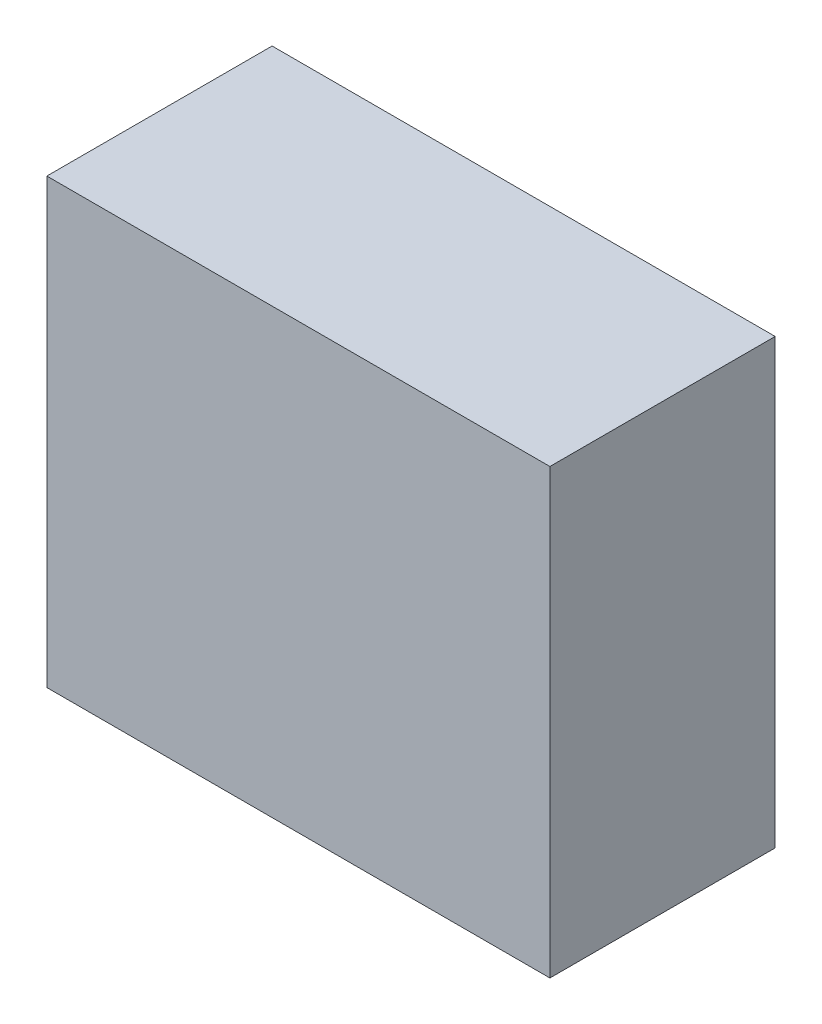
ISO-10303-21;
HEADER;
FILE_DESCRIPTION(('STEP AP214'),'2;1');
FILE_NAME('part.step','',(''),(''),'','','');
FILE_SCHEMA(('AUTOMOTIVE_DESIGN { 1 0 10303 214 1 1 1 1 }'));
ENDSEC;
DATA;
#1=APPLICATION_CONTEXT('core data for automotive mechanical design processes');
#2=APPLICATION_PROTOCOL_DEFINITION('international standard','automotive_design',2000,#1);
#3=PRODUCT_CONTEXT('',#1,'mechanical');
#4=PRODUCT('Part','Part','',(#3));
#5=PRODUCT_RELATED_PRODUCT_CATEGORY('part','',(#4));
#6=PRODUCT_DEFINITION_FORMATION('','',#4);
#7=PRODUCT_DEFINITION_CONTEXT('part definition',#1,'design');
#8=PRODUCT_DEFINITION('design','',#6,#7);
#9=PRODUCT_DEFINITION_SHAPE('','',#8);
#10=(LENGTH_UNIT() NAMED_UNIT(*) SI_UNIT(.MILLI.,.METRE.));
#11=(NAMED_UNIT(*) PLANE_ANGLE_UNIT() SI_UNIT($,.RADIAN.));
#12=(NAMED_UNIT(*) SI_UNIT($,.STERADIAN.) SOLID_ANGLE_UNIT());
#13=UNCERTAINTY_MEASURE_WITH_UNIT(LENGTH_MEASURE(1.E-05),#10,'distance_accuracy_value','');
#14=(GEOMETRIC_REPRESENTATION_CONTEXT(3) GLOBAL_UNCERTAINTY_ASSIGNED_CONTEXT((#13)) GLOBAL_UNIT_ASSIGNED_CONTEXT((#10,
#11,#12)) REPRESENTATION_CONTEXT('',''));
#15=CARTESIAN_POINT('',(0.,0.,0.));
#16=DIRECTION('',(0.,0.,1.));
#17=DIRECTION('',(1.,0.,0.));
#18=AXIS2_PLACEMENT_3D('',#15,#16,#17);
#19=CARTESIAN_POINT('',(-3.35000092,-2.94999918,2.99999908));
#20=DIRECTION('',(0.,0.,-1.));
#21=DIRECTION('',(-1.,0.,0.));
#22=AXIS2_PLACEMENT_3D('',#19,#20,#21);
#23=PLANE('',#22);
#24=DIRECTION('',(0.,1.,0.));
#25=VECTOR('',#24,1.);
#26=CARTESIAN_POINT('',(3.35000346,-2.95000172,2.99999908));
#27=LINE('',#26,#25);
#28=CARTESIAN_POINT('',(3.35000346,-2.95000172,2.99999908));
#29=VERTEX_POINT('',#28);
#30=CARTESIAN_POINT('',(3.35000346,2.95000299,2.99999908));
#31=VERTEX_POINT('',#30);
#32=EDGE_CURVE('E54',#29,#31,#27,.T.);
#33=ORIENTED_EDGE('',*,*,#32,.T.);
#34=DIRECTION('',(0.999999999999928,-3.79104229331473E-07,0.));
#35=VECTOR('',#34,1.);
#36=CARTESIAN_POINT('',(3.35000346,2.95000172,2.99999908));
#37=LINE('',#36,#35);
#38=CARTESIAN_POINT('',(-3.35000092,2.95000426,2.99999908));
#39=VERTEX_POINT('',#38);
#40=EDGE_CURVE('E56',#31,#39,#37,.F.);
#41=ORIENTED_EDGE('',*,*,#40,.T.);
#42=DIRECTION('',(0.,1.,0.));
#43=VECTOR('',#42,1.);
#44=CARTESIAN_POINT('',(-3.35000092,2.95000426,2.99999908));
#45=LINE('',#44,#43);
#46=CARTESIAN_POINT('',(-3.35000092,-2.949999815,2.99999908));
#47=VERTEX_POINT('',#46);
#48=EDGE_CURVE('E19',#39,#47,#45,.F.);
#49=ORIENTED_EDGE('',*,*,#48,.T.);
#50=DIRECTION('',(-0.999999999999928,3.79104229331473E-07,0.));
#51=VECTOR('',#50,1.);
#52=CARTESIAN_POINT('',(-3.35000092,-2.94999918,2.99999908));
#53=LINE('',#52,#51);
#54=EDGE_CURVE('E79',#47,#29,#53,.F.);
#55=ORIENTED_EDGE('',*,*,#54,.T.);
#56=EDGE_LOOP('',(#33,#41,#49,#55));
#57=FACE_BOUND('',#56,.T.);
#58=ADVANCED_FACE('F16',(#57),#23,.F.);
#59=CARTESIAN_POINT('',(-3.35000092,2.95000426,0.));
#60=DIRECTION('',(1.,0.,0.));
#61=DIRECTION('',(0.,0.,-1.));
#62=AXIS2_PLACEMENT_3D('',#59,#60,#61);
#63=PLANE('',#62);
#64=DIRECTION('',(0.,0.,1.));
#65=VECTOR('',#64,1.);
#66=CARTESIAN_POINT('',(-3.35000092,-2.94999918,0.));
#67=LINE('',#66,#65);
#68=CARTESIAN_POINT('',(-3.35000092,-2.949999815,0.));
#69=VERTEX_POINT('',#68);
#70=EDGE_CURVE('E67',#69,#47,#67,.T.);
#71=ORIENTED_EDGE('',*,*,#70,.T.);
#72=ORIENTED_EDGE('',*,*,#48,.F.);
#73=DIRECTION('',(0.,0.,1.));
#74=VECTOR('',#73,1.);
#75=CARTESIAN_POINT('',(-3.35000092,2.95000426,0.));
#76=LINE('',#75,#74);
#77=CARTESIAN_POINT('',(-3.35000092,2.95000426,0.));
#78=VERTEX_POINT('',#77);
#79=EDGE_CURVE('E62',#39,#78,#76,.F.);
#80=ORIENTED_EDGE('',*,*,#79,.T.);
#81=DIRECTION('',(0.,1.,0.));
#82=VECTOR('',#81,1.);
#83=CARTESIAN_POINT('',(-3.35000092,-2.94999918,0.));
#84=LINE('',#83,#82);
#85=EDGE_CURVE('E82',#69,#78,#84,.T.);
#86=ORIENTED_EDGE('',*,*,#85,.F.);
#87=EDGE_LOOP('',(#71,#72,#80,#86));
#88=FACE_BOUND('',#87,.T.);
#89=ADVANCED_FACE('F64',(#88),#63,.F.);
#90=CARTESIAN_POINT('',(3.35000346,2.95000172,0.));
#91=DIRECTION('',(-3.79104229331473E-07,-0.999999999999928,0.));
#92=DIRECTION('',(0.999999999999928,-3.79104229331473E-07,0.));
#93=AXIS2_PLACEMENT_3D('',#90,#91,#92);
#94=PLANE('',#93);
#95=ORIENTED_EDGE('',*,*,#79,.F.);
#96=ORIENTED_EDGE('',*,*,#40,.F.);
#97=DIRECTION('',(0.,0.,1.));
#98=VECTOR('',#97,1.);
#99=CARTESIAN_POINT('',(3.35000346,2.95000172,0.));
#100=LINE('',#99,#98);
#101=CARTESIAN_POINT('',(3.35000346,2.950002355,0.));
#102=VERTEX_POINT('',#101);
#103=EDGE_CURVE('E74',#31,#102,#100,.F.);
#104=ORIENTED_EDGE('',*,*,#103,.T.);
#105=DIRECTION('',(-1.,0.,0.));
#106=VECTOR('',#105,1.);
#107=CARTESIAN_POINT('',(-3.35000092,2.95000426,0.));
#108=LINE('',#107,#106);
#109=EDGE_CURVE('E71',#78,#102,#108,.F.);
#110=ORIENTED_EDGE('',*,*,#109,.F.);
#111=EDGE_LOOP('',(#95,#96,#104,#110));
#112=FACE_BOUND('',#111,.T.);
#113=ADVANCED_FACE('F69',(#112),#94,.F.);
#114=CARTESIAN_POINT('',(3.35000346,-2.95000172,0.));
#115=DIRECTION('',(-1.,0.,0.));
#116=DIRECTION('',(0.,0.,1.));
#117=AXIS2_PLACEMENT_3D('',#114,#115,#116);
#118=PLANE('',#117);
#119=ORIENTED_EDGE('',*,*,#103,.F.);
#120=ORIENTED_EDGE('',*,*,#32,.F.);
#121=DIRECTION('',(0.,0.,1.));
#122=VECTOR('',#121,1.);
#123=CARTESIAN_POINT('',(3.35000346,-2.95000172,0.));
#124=LINE('',#123,#122);
#125=CARTESIAN_POINT('',(3.35000346,-2.95000172,0.));
#126=VERTEX_POINT('',#125);
#127=EDGE_CURVE('E34',#29,#126,#124,.F.);
#128=ORIENTED_EDGE('',*,*,#127,.T.);
#129=DIRECTION('',(0.,1.,0.));
#130=VECTOR('',#129,1.);
#131=CARTESIAN_POINT('',(3.35000346,-2.94999918,0.));
#132=LINE('',#131,#130);
#133=EDGE_CURVE('E25',#102,#126,#132,.F.);
#134=ORIENTED_EDGE('',*,*,#133,.F.);
#135=EDGE_LOOP('',(#119,#120,#128,#134));
#136=FACE_BOUND('',#135,.T.);
#137=ADVANCED_FACE('F88',(#136),#118,.F.);
#138=CARTESIAN_POINT('',(-3.35000092,-2.94999918,0.));
#139=DIRECTION('',(3.79104229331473E-07,0.999999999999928,0.));
#140=DIRECTION('',(-0.999999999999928,3.79104229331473E-07,0.));
#141=AXIS2_PLACEMENT_3D('',#138,#139,#140);
#142=PLANE('',#141);
#143=ORIENTED_EDGE('',*,*,#127,.F.);
#144=ORIENTED_EDGE('',*,*,#54,.F.);
#145=ORIENTED_EDGE('',*,*,#70,.F.);
#146=DIRECTION('',(-1.,0.,0.));
#147=VECTOR('',#146,1.);
#148=CARTESIAN_POINT('',(-3.35000092,-2.95000172,0.));
#149=LINE('',#148,#147);
#150=EDGE_CURVE('E11',#126,#69,#149,.T.);
#151=ORIENTED_EDGE('',*,*,#150,.F.);
#152=EDGE_LOOP('',(#143,#144,#145,#151));
#153=FACE_BOUND('',#152,.T.);
#154=ADVANCED_FACE('F90',(#153),#142,.F.);
#155=CARTESIAN_POINT('',(-3.35000092,-2.94999918,0.));
#156=DIRECTION('',(0.,0.,-1.));
#157=DIRECTION('',(-1.,0.,0.));
#158=AXIS2_PLACEMENT_3D('',#155,#156,#157);
#159=PLANE('',#158);
#160=ORIENTED_EDGE('',*,*,#133,.T.);
#161=ORIENTED_EDGE('',*,*,#150,.T.);
#162=ORIENTED_EDGE('',*,*,#85,.T.);
#163=ORIENTED_EDGE('',*,*,#109,.T.);
#164=EDGE_LOOP('',(#160,#161,#162,#163));
#165=FACE_BOUND('',#164,.T.);
#166=ADVANCED_FACE('F87',(#165),#159,.T.);
#167=CLOSED_SHELL('',(#58,#89,#113,#137,#154,#166));
#168=MANIFOLD_SOLID_BREP('B1',#167);
#169=ADVANCED_BREP_SHAPE_REPRESENTATION('',(#18,#168),#14);
#170=SHAPE_DEFINITION_REPRESENTATION(#9,#169);
ENDSEC;
END-ISO-10303-21;
